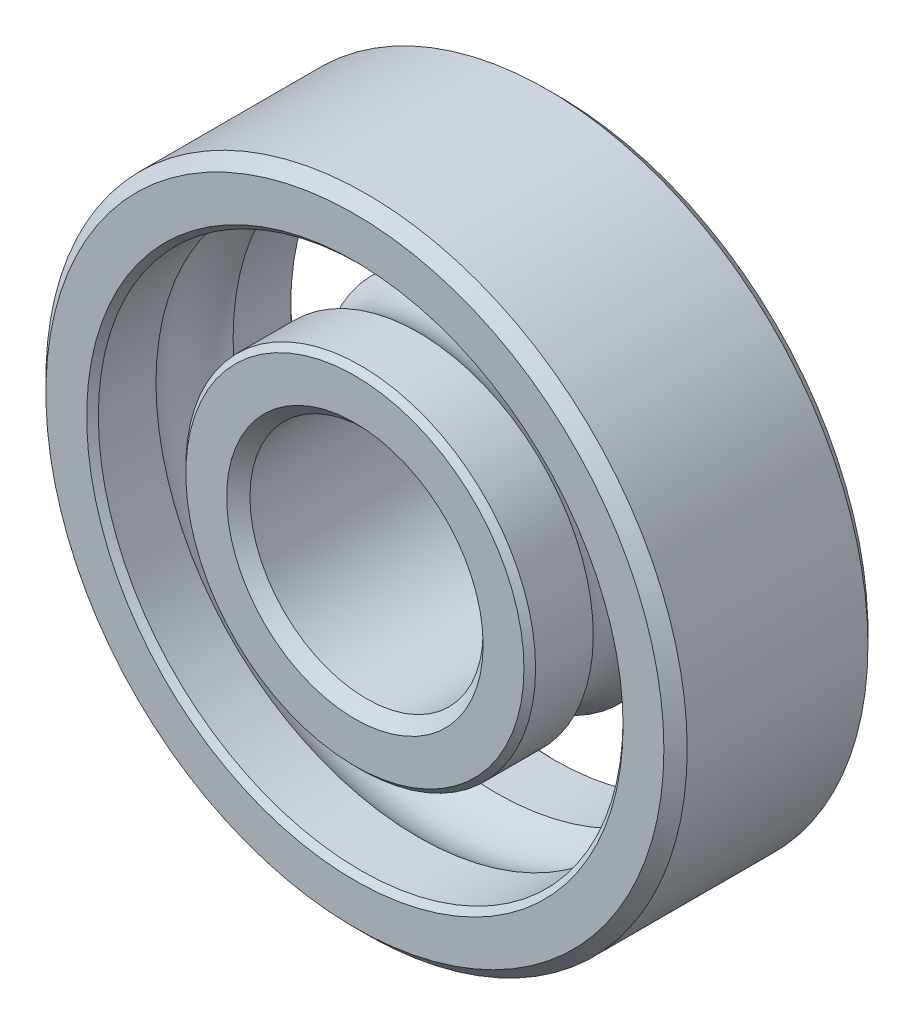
ISO-10303-21;
HEADER;
FILE_DESCRIPTION(('STEP AP214'),'2;1');
FILE_NAME('part.step','',(''),(''),'','','');
FILE_SCHEMA(('AUTOMOTIVE_DESIGN { 1 0 10303 214 1 1 1 1 }'));
ENDSEC;
DATA;
#1=APPLICATION_CONTEXT('core data for automotive mechanical design processes');
#2=APPLICATION_PROTOCOL_DEFINITION('international standard','automotive_design',2000,#1);
#3=PRODUCT_CONTEXT('',#1,'mechanical');
#4=PRODUCT('Part','Part','',(#3));
#5=PRODUCT_RELATED_PRODUCT_CATEGORY('part','',(#4));
#6=PRODUCT_DEFINITION_FORMATION('','',#4);
#7=PRODUCT_DEFINITION_CONTEXT('part definition',#1,'design');
#8=PRODUCT_DEFINITION('design','',#6,#7);
#9=PRODUCT_DEFINITION_SHAPE('','',#8);
#10=(LENGTH_UNIT() NAMED_UNIT(*) SI_UNIT(.MILLI.,.METRE.));
#11=(NAMED_UNIT(*) PLANE_ANGLE_UNIT() SI_UNIT($,.RADIAN.));
#12=(NAMED_UNIT(*) SI_UNIT($,.STERADIAN.) SOLID_ANGLE_UNIT());
#13=UNCERTAINTY_MEASURE_WITH_UNIT(LENGTH_MEASURE(1.E-05),#10,'distance_accuracy_value','');
#14=(GEOMETRIC_REPRESENTATION_CONTEXT(3) GLOBAL_UNCERTAINTY_ASSIGNED_CONTEXT((#13)) GLOBAL_UNIT_ASSIGNED_CONTEXT((#10,
#11,#12)) REPRESENTATION_CONTEXT('',''));
#15=CARTESIAN_POINT('',(0.,0.,0.));
#16=DIRECTION('',(0.,0.,1.));
#17=DIRECTION('',(1.,0.,0.));
#18=AXIS2_PLACEMENT_3D('',#15,#16,#17);
#19=CARTESIAN_POINT('',(0.,0.,0.));
#20=DIRECTION('',(0.,0.,1.));
#21=DIRECTION('',(1.,0.,0.));
#22=AXIS2_PLACEMENT_3D('',#19,#20,#21);
#23=CYLINDRICAL_SURFACE('',#22,9.);
#24=CARTESIAN_POINT('',(0.,0.,3.3));
#25=DIRECTION('',(0.,0.,1.));
#26=DIRECTION('',(1.,0.,0.));
#27=AXIS2_PLACEMENT_3D('',#24,#25,#26);
#28=CIRCLE('',#27,9.);
#29=CARTESIAN_POINT('',(9.,0.,3.3));
#30=VERTEX_POINT('',#29);
#31=EDGE_CURVE('E65',#30,#30,#28,.T.);
#32=ORIENTED_EDGE('',*,*,#31,.T.);
#33=EDGE_LOOP('',(#32));
#34=FACE_BOUND('',#33,.T.);
#35=CARTESIAN_POINT('',(0.,0.,1.32287565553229));
#36=DIRECTION('',(0.,0.,1.));
#37=DIRECTION('',(1.,0.,0.));
#38=AXIS2_PLACEMENT_3D('',#35,#36,#37);
#39=CIRCLE('',#38,9.);
#40=CARTESIAN_POINT('',(9.,0.,1.32287565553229));
#41=VERTEX_POINT('',#40);
#42=EDGE_CURVE('E71',#41,#41,#39,.T.);
#43=ORIENTED_EDGE('',*,*,#42,.F.);
#44=EDGE_LOOP('',(#43));
#45=FACE_BOUND('',#44,.T.);
#46=ADVANCED_FACE('F36',(#34,#45),#23,.F.);
#47=CARTESIAN_POINT('',(11.,0.,3.5));
#48=DIRECTION('',(0.,0.,1.));
#49=DIRECTION('',(1.,0.,0.));
#50=AXIS2_PLACEMENT_3D('',#47,#48,#49);
#51=PLANE('',#50);
#52=CARTESIAN_POINT('',(0.,0.,3.5));
#53=DIRECTION('',(0.,0.,1.));
#54=DIRECTION('',(1.,0.,0.));
#55=AXIS2_PLACEMENT_3D('',#52,#53,#54);
#56=CIRCLE('',#55,10.6);
#57=CARTESIAN_POINT('',(10.6,0.,3.5));
#58=VERTEX_POINT('',#57);
#59=EDGE_CURVE('E51',#58,#58,#56,.T.);
#60=ORIENTED_EDGE('',*,*,#59,.T.);
#61=EDGE_LOOP('',(#60));
#62=FACE_BOUND('',#61,.T.);
#63=CARTESIAN_POINT('',(0.,0.,3.5));
#64=DIRECTION('',(0.,0.,1.));
#65=DIRECTION('',(1.,0.,0.));
#66=AXIS2_PLACEMENT_3D('',#63,#64,#65);
#67=CIRCLE('',#66,9.2);
#68=CARTESIAN_POINT('',(9.2,0.,3.5));
#69=VERTEX_POINT('',#68);
#70=EDGE_CURVE('E62',#69,#69,#67,.F.);
#71=ORIENTED_EDGE('',*,*,#70,.T.);
#72=EDGE_LOOP('',(#71));
#73=FACE_BOUND('',#72,.T.);
#74=ADVANCED_FACE('F79',(#62,#73),#51,.T.);
#75=CARTESIAN_POINT('',(0.,0.,0.));
#76=DIRECTION('',(0.,0.,1.));
#77=DIRECTION('',(1.,0.,0.));
#78=AXIS2_PLACEMENT_3D('',#75,#76,#77);
#79=CYLINDRICAL_SURFACE('',#78,11.);
#80=CARTESIAN_POINT('',(0.,0.,3.09999999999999));
#81=DIRECTION('',(0.,0.,1.));
#82=DIRECTION('',(1.,0.,0.));
#83=AXIS2_PLACEMENT_3D('',#80,#81,#82);
#84=CIRCLE('',#83,11.);
#85=CARTESIAN_POINT('',(11.,0.,3.09999999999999));
#86=VERTEX_POINT('',#85);
#87=EDGE_CURVE('E43',#86,#86,#84,.F.);
#88=ORIENTED_EDGE('',*,*,#87,.T.);
#89=EDGE_LOOP('',(#88));
#90=FACE_BOUND('',#89,.T.);
#91=CARTESIAN_POINT('',(0.,0.,-3.1));
#92=DIRECTION('',(0.,0.,-1.));
#93=DIRECTION('',(-1.,0.,0.));
#94=AXIS2_PLACEMENT_3D('',#91,#92,#93);
#95=CIRCLE('',#94,11.);
#96=CARTESIAN_POINT('',(-11.,0.,-3.1));
#97=VERTEX_POINT('',#96);
#98=EDGE_CURVE('E47',#97,#97,#95,.F.);
#99=ORIENTED_EDGE('',*,*,#98,.T.);
#100=EDGE_LOOP('',(#99));
#101=FACE_BOUND('',#100,.T.);
#102=ADVANCED_FACE('F85',(#90,#101),#79,.T.);
#103=CARTESIAN_POINT('',(11.,0.,-3.5));
#104=DIRECTION('',(0.,0.,-1.));
#105=DIRECTION('',(-1.,0.,0.));
#106=AXIS2_PLACEMENT_3D('',#103,#104,#105);
#107=PLANE('',#106);
#108=CARTESIAN_POINT('',(0.,0.,-3.5));
#109=DIRECTION('',(0.,0.,-1.));
#110=DIRECTION('',(-1.,0.,0.));
#111=AXIS2_PLACEMENT_3D('',#108,#109,#110);
#112=CIRCLE('',#111,10.6);
#113=CARTESIAN_POINT('',(-10.6,0.,-3.5));
#114=VERTEX_POINT('',#113);
#115=EDGE_CURVE('E11',#114,#114,#112,.T.);
#116=ORIENTED_EDGE('',*,*,#115,.T.);
#117=EDGE_LOOP('',(#116));
#118=FACE_BOUND('',#117,.T.);
#119=CARTESIAN_POINT('',(0.,0.,-3.5));
#120=DIRECTION('',(0.,0.,-1.));
#121=DIRECTION('',(-1.,0.,0.));
#122=AXIS2_PLACEMENT_3D('',#119,#120,#121);
#123=CIRCLE('',#122,9.2);
#124=CARTESIAN_POINT('',(-9.2,0.,-3.5));
#125=VERTEX_POINT('',#124);
#126=EDGE_CURVE('E59',#125,#125,#123,.F.);
#127=ORIENTED_EDGE('',*,*,#126,.T.);
#128=EDGE_LOOP('',(#127));
#129=FACE_BOUND('',#128,.T.);
#130=ADVANCED_FACE('F116',(#118,#129),#107,.T.);
#131=CARTESIAN_POINT('',(0.,0.,0.));
#132=DIRECTION('',(0.,0.,1.));
#133=DIRECTION('',(1.,0.,0.));
#134=AXIS2_PLACEMENT_3D('',#131,#132,#133);
#135=CYLINDRICAL_SURFACE('',#134,9.);
#136=CARTESIAN_POINT('',(0.,0.,-3.3));
#137=DIRECTION('',(0.,0.,-1.));
#138=DIRECTION('',(-1.,0.,0.));
#139=AXIS2_PLACEMENT_3D('',#136,#137,#138);
#140=CIRCLE('',#139,9.);
#141=CARTESIAN_POINT('',(-9.,0.,-3.3));
#142=VERTEX_POINT('',#141);
#143=EDGE_CURVE('E56',#142,#142,#140,.T.);
#144=ORIENTED_EDGE('',*,*,#143,.T.);
#145=EDGE_LOOP('',(#144));
#146=FACE_BOUND('',#145,.T.);
#147=CARTESIAN_POINT('',(0.,0.,-1.32287565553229));
#148=DIRECTION('',(0.,0.,1.));
#149=DIRECTION('',(1.,0.,0.));
#150=AXIS2_PLACEMENT_3D('',#147,#148,#149);
#151=CIRCLE('',#150,9.);
#152=CARTESIAN_POINT('',(9.,0.,-1.32287565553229));
#153=VERTEX_POINT('',#152);
#154=EDGE_CURVE('E68',#153,#153,#151,.T.);
#155=ORIENTED_EDGE('',*,*,#154,.T.);
#156=EDGE_LOOP('',(#155));
#157=FACE_BOUND('',#156,.T.);
#158=ADVANCED_FACE('F120',(#146,#157),#135,.F.);
#159=CARTESIAN_POINT('',(0.,0.,0.));
#160=DIRECTION('',(0.,0.,1.));
#161=DIRECTION('',(1.,0.,0.));
#162=AXIS2_PLACEMENT_3D('',#159,#160,#161);
#163=TOROIDAL_SURFACE('',#162,7.5,2.);
#164=ORIENTED_EDGE('',*,*,#42,.T.);
#165=EDGE_LOOP('',(#164));
#166=FACE_BOUND('',#165,.T.);
#167=ORIENTED_EDGE('',*,*,#154,.F.);
#168=EDGE_LOOP('',(#167));
#169=FACE_BOUND('',#168,.T.);
#170=ADVANCED_FACE('F75',(#166,#169),#163,.F.);
#171=CARTESIAN_POINT('',(0.,0.,3.3));
#172=DIRECTION('',(0.,0.,1.));
#173=DIRECTION('',(1.,0.,0.));
#174=AXIS2_PLACEMENT_3D('',#171,#172,#173);
#175=CONICAL_SURFACE('',#174,9.,0.785398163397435);
#176=ORIENTED_EDGE('',*,*,#70,.F.);
#177=EDGE_LOOP('',(#176));
#178=FACE_BOUND('',#177,.T.);
#179=ORIENTED_EDGE('',*,*,#31,.F.);
#180=EDGE_LOOP('',(#179));
#181=FACE_BOUND('',#180,.T.);
#182=ADVANCED_FACE('F90',(#178,#181),#175,.F.);
#183=CARTESIAN_POINT('',(0.,0.,-3.5));
#184=DIRECTION('',(0.,0.,-1.));
#185=DIRECTION('',(-1.,0.,0.));
#186=AXIS2_PLACEMENT_3D('',#183,#184,#185);
#187=CONICAL_SURFACE('',#186,9.2,0.785398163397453);
#188=ORIENTED_EDGE('',*,*,#143,.F.);
#189=EDGE_LOOP('',(#188));
#190=FACE_BOUND('',#189,.T.);
#191=ORIENTED_EDGE('',*,*,#126,.F.);
#192=EDGE_LOOP('',(#191));
#193=FACE_BOUND('',#192,.T.);
#194=ADVANCED_FACE('F93',(#190,#193),#187,.F.);
#195=CARTESIAN_POINT('',(0.,0.,3.5));
#196=DIRECTION('',(0.,0.,-1.));
#197=DIRECTION('',(-1.,0.,0.));
#198=AXIS2_PLACEMENT_3D('',#195,#196,#197);
#199=CONICAL_SURFACE('',#198,10.6,0.785398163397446);
#200=ORIENTED_EDGE('',*,*,#87,.F.);
#201=EDGE_LOOP('',(#200));
#202=FACE_BOUND('',#201,.T.);
#203=ORIENTED_EDGE('',*,*,#59,.F.);
#204=EDGE_LOOP('',(#203));
#205=FACE_BOUND('',#204,.T.);
#206=ADVANCED_FACE('F96',(#202,#205),#199,.T.);
#207=CARTESIAN_POINT('',(0.,0.,-3.1));
#208=DIRECTION('',(0.,0.,1.));
#209=DIRECTION('',(1.,0.,0.));
#210=AXIS2_PLACEMENT_3D('',#207,#208,#209);
#211=CONICAL_SURFACE('',#210,11.,0.785398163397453);
#212=ORIENTED_EDGE('',*,*,#115,.F.);
#213=EDGE_LOOP('',(#212));
#214=FACE_BOUND('',#213,.T.);
#215=ORIENTED_EDGE('',*,*,#98,.F.);
#216=EDGE_LOOP('',(#215));
#217=FACE_BOUND('',#216,.T.);
#218=ADVANCED_FACE('F38',(#214,#217),#211,.T.);
#219=CLOSED_SHELL('',(#46,#74,#102,#130,#158,#170,#182,#194,#206,#218));
#220=MANIFOLD_SOLID_BREP('B2',#219);
#221=CARTESIAN_POINT('',(0.,0.,0.));
#222=DIRECTION('',(0.,0.,1.));
#223=DIRECTION('',(1.,0.,0.));
#224=AXIS2_PLACEMENT_3D('',#221,#222,#223);
#225=CYLINDRICAL_SURFACE('',#224,4.);
#226=CARTESIAN_POINT('',(0.,0.,-3.1));
#227=DIRECTION('',(0.,0.,-1.));
#228=DIRECTION('',(-1.,0.,0.));
#229=AXIS2_PLACEMENT_3D('',#226,#227,#228);
#230=CIRCLE('',#229,4.);
#231=CARTESIAN_POINT('',(-4.,0.,-3.1));
#232=VERTEX_POINT('',#231);
#233=EDGE_CURVE('E210',#232,#232,#230,.T.);
#234=ORIENTED_EDGE('',*,*,#233,.T.);
#235=EDGE_LOOP('',(#234));
#236=FACE_BOUND('',#235,.T.);
#237=CARTESIAN_POINT('',(0.,0.,3.1));
#238=DIRECTION('',(0.,0.,1.));
#239=DIRECTION('',(1.,0.,0.));
#240=AXIS2_PLACEMENT_3D('',#237,#238,#239);
#241=CIRCLE('',#240,4.);
#242=CARTESIAN_POINT('',(4.,0.,3.1));
#243=VERTEX_POINT('',#242);
#244=EDGE_CURVE('E213',#243,#243,#241,.T.);
#245=ORIENTED_EDGE('',*,*,#244,.T.);
#246=EDGE_LOOP('',(#245));
#247=FACE_BOUND('',#246,.T.);
#248=ADVANCED_FACE('F187',(#236,#247),#225,.F.);
#249=CARTESIAN_POINT('',(4.,0.,-3.5));
#250=DIRECTION('',(0.,0.,-1.));
#251=DIRECTION('',(-1.,0.,0.));
#252=AXIS2_PLACEMENT_3D('',#249,#250,#251);
#253=PLANE('',#252);
#254=CARTESIAN_POINT('',(0.,0.,-3.5));
#255=DIRECTION('',(0.,0.,-1.));
#256=DIRECTION('',(-1.,0.,0.));
#257=AXIS2_PLACEMENT_3D('',#254,#255,#256);
#258=CIRCLE('',#257,5.8);
#259=CARTESIAN_POINT('',(-5.8,0.,-3.5));
#260=VERTEX_POINT('',#259);
#261=EDGE_CURVE('E198',#260,#260,#258,.T.);
#262=ORIENTED_EDGE('',*,*,#261,.T.);
#263=EDGE_LOOP('',(#262));
#264=FACE_BOUND('',#263,.T.);
#265=CARTESIAN_POINT('',(0.,0.,-3.5));
#266=DIRECTION('',(0.,0.,-1.));
#267=DIRECTION('',(-1.,0.,0.));
#268=AXIS2_PLACEMENT_3D('',#265,#266,#267);
#269=CIRCLE('',#268,4.4);
#270=CARTESIAN_POINT('',(-4.4,0.,-3.5));
#271=VERTEX_POINT('',#270);
#272=EDGE_CURVE('E216',#271,#271,#269,.F.);
#273=ORIENTED_EDGE('',*,*,#272,.T.);
#274=EDGE_LOOP('',(#273));
#275=FACE_BOUND('',#274,.T.);
#276=ADVANCED_FACE('F239',(#264,#275),#253,.T.);
#277=CARTESIAN_POINT('',(0.,0.,0.));
#278=DIRECTION('',(0.,0.,1.));
#279=DIRECTION('',(1.,0.,0.));
#280=AXIS2_PLACEMENT_3D('',#277,#278,#279);
#281=CYLINDRICAL_SURFACE('',#280,6.);
#282=CARTESIAN_POINT('',(0.,0.,-3.3));
#283=DIRECTION('',(0.,0.,-1.));
#284=DIRECTION('',(-1.,0.,0.));
#285=AXIS2_PLACEMENT_3D('',#282,#283,#284);
#286=CIRCLE('',#285,6.);
#287=CARTESIAN_POINT('',(-6.,0.,-3.3));
#288=VERTEX_POINT('',#287);
#289=EDGE_CURVE('E202',#288,#288,#286,.F.);
#290=ORIENTED_EDGE('',*,*,#289,.T.);
#291=EDGE_LOOP('',(#290));
#292=FACE_BOUND('',#291,.T.);
#293=CARTESIAN_POINT('',(0.,0.,-1.32287565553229));
#294=DIRECTION('',(0.,0.,1.));
#295=DIRECTION('',(1.,0.,0.));
#296=AXIS2_PLACEMENT_3D('',#293,#294,#295);
#297=CIRCLE('',#296,6.);
#298=CARTESIAN_POINT('',(6.,0.,-1.32287565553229));
#299=VERTEX_POINT('',#298);
#300=EDGE_CURVE('E219',#299,#299,#297,.T.);
#301=ORIENTED_EDGE('',*,*,#300,.F.);
#302=EDGE_LOOP('',(#301));
#303=FACE_BOUND('',#302,.T.);
#304=ADVANCED_FACE('F230',(#292,#303),#281,.T.);
#305=CARTESIAN_POINT('',(0.,0.,0.));
#306=DIRECTION('',(0.,0.,1.));
#307=DIRECTION('',(1.,0.,0.));
#308=AXIS2_PLACEMENT_3D('',#305,#306,#307);
#309=TOROIDAL_SURFACE('',#308,7.5,2.);
#310=ORIENTED_EDGE('',*,*,#300,.T.);
#311=EDGE_LOOP('',(#310));
#312=FACE_BOUND('',#311,.T.);
#313=CARTESIAN_POINT('',(0.,0.,1.3228756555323));
#314=DIRECTION('',(0.,0.,1.));
#315=DIRECTION('',(1.,0.,0.));
#316=AXIS2_PLACEMENT_3D('',#313,#314,#315);
#317=CIRCLE('',#316,6.);
#318=CARTESIAN_POINT('',(6.,0.,1.3228756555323));
#319=VERTEX_POINT('',#318);
#320=EDGE_CURVE('E222',#319,#319,#317,.T.);
#321=ORIENTED_EDGE('',*,*,#320,.F.);
#322=EDGE_LOOP('',(#321));
#323=FACE_BOUND('',#322,.T.);
#324=ADVANCED_FACE('F228',(#312,#323),#309,.F.);
#325=CARTESIAN_POINT('',(0.,0.,0.));
#326=DIRECTION('',(0.,0.,1.));
#327=DIRECTION('',(1.,0.,0.));
#328=AXIS2_PLACEMENT_3D('',#325,#326,#327);
#329=CYLINDRICAL_SURFACE('',#328,6.);
#330=CARTESIAN_POINT('',(0.,0.,3.3));
#331=DIRECTION('',(0.,0.,1.));
#332=DIRECTION('',(1.,0.,0.));
#333=AXIS2_PLACEMENT_3D('',#330,#331,#332);
#334=CIRCLE('',#333,6.);
#335=CARTESIAN_POINT('',(6.,0.,3.3));
#336=VERTEX_POINT('',#335);
#337=EDGE_CURVE('E35',#336,#336,#334,.F.);
#338=ORIENTED_EDGE('',*,*,#337,.T.);
#339=EDGE_LOOP('',(#338));
#340=FACE_BOUND('',#339,.T.);
#341=ORIENTED_EDGE('',*,*,#320,.T.);
#342=EDGE_LOOP('',(#341));
#343=FACE_BOUND('',#342,.T.);
#344=ADVANCED_FACE('F226',(#340,#343),#329,.T.);
#345=CARTESIAN_POINT('',(4.,0.,3.5));
#346=DIRECTION('',(0.,0.,1.));
#347=DIRECTION('',(1.,0.,0.));
#348=AXIS2_PLACEMENT_3D('',#345,#346,#347);
#349=PLANE('',#348);
#350=CARTESIAN_POINT('',(0.,0.,3.5));
#351=DIRECTION('',(0.,0.,1.));
#352=DIRECTION('',(1.,0.,0.));
#353=AXIS2_PLACEMENT_3D('',#350,#351,#352);
#354=CIRCLE('',#353,5.79999999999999);
#355=CARTESIAN_POINT('',(5.79999999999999,0.,3.5));
#356=VERTEX_POINT('',#355);
#357=EDGE_CURVE('E194',#356,#356,#354,.T.);
#358=ORIENTED_EDGE('',*,*,#357,.T.);
#359=EDGE_LOOP('',(#358));
#360=FACE_BOUND('',#359,.T.);
#361=CARTESIAN_POINT('',(0.,0.,3.5));
#362=DIRECTION('',(0.,0.,1.));
#363=DIRECTION('',(1.,0.,0.));
#364=AXIS2_PLACEMENT_3D('',#361,#362,#363);
#365=CIRCLE('',#364,4.4);
#366=CARTESIAN_POINT('',(4.4,0.,3.5));
#367=VERTEX_POINT('',#366);
#368=EDGE_CURVE('E207',#367,#367,#365,.F.);
#369=ORIENTED_EDGE('',*,*,#368,.T.);
#370=EDGE_LOOP('',(#369));
#371=FACE_BOUND('',#370,.T.);
#372=ADVANCED_FACE('F237',(#360,#371),#349,.T.);
#373=CARTESIAN_POINT('',(0.,0.,-3.5));
#374=DIRECTION('',(0.,0.,-1.));
#375=DIRECTION('',(-1.,0.,0.));
#376=AXIS2_PLACEMENT_3D('',#373,#374,#375);
#377=CONICAL_SURFACE('',#376,4.4,0.785398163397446);
#378=CARTESIAN_POINT('',(-4.,0.,-3.1));
#379=CARTESIAN_POINT('',(-4.00416666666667,0.,-3.10416666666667));
#380=CARTESIAN_POINT('',(-4.00833333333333,0.,-3.10833333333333));
#381=CARTESIAN_POINT('',(-4.01666666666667,0.,-3.11666666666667));
#382=CARTESIAN_POINT('',(-4.02083333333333,0.,-3.12083333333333));
#383=CARTESIAN_POINT('',(-4.02916666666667,0.,-3.12916666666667));
#384=CARTESIAN_POINT('',(-4.03333333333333,0.,-3.13333333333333));
#385=CARTESIAN_POINT('',(-4.04166666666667,0.,-3.14166666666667));
#386=CARTESIAN_POINT('',(-4.04583333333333,0.,-3.14583333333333));
#387=CARTESIAN_POINT('',(-4.05416666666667,0.,-3.15416666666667));
#388=CARTESIAN_POINT('',(-4.05833333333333,0.,-3.15833333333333));
#389=CARTESIAN_POINT('',(-4.06666666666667,0.,-3.16666666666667));
#390=CARTESIAN_POINT('',(-4.07083333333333,0.,-3.17083333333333));
#391=CARTESIAN_POINT('',(-4.07916666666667,0.,-3.17916666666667));
#392=CARTESIAN_POINT('',(-4.08333333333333,0.,-3.18333333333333));
#393=CARTESIAN_POINT('',(-4.09166666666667,0.,-3.19166666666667));
#394=CARTESIAN_POINT('',(-4.09583333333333,0.,-3.19583333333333));
#395=CARTESIAN_POINT('',(-4.10416666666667,0.,-3.20416666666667));
#396=CARTESIAN_POINT('',(-4.10833333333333,0.,-3.20833333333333));
#397=CARTESIAN_POINT('',(-4.11666666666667,0.,-3.21666666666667));
#398=CARTESIAN_POINT('',(-4.12083333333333,0.,-3.22083333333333));
#399=CARTESIAN_POINT('',(-4.12916666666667,0.,-3.22916666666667));
#400=CARTESIAN_POINT('',(-4.13333333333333,0.,-3.23333333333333));
#401=CARTESIAN_POINT('',(-4.14166666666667,0.,-3.24166666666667));
#402=CARTESIAN_POINT('',(-4.14583333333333,0.,-3.24583333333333));
#403=CARTESIAN_POINT('',(-4.15416666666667,0.,-3.25416666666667));
#404=CARTESIAN_POINT('',(-4.15833333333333,0.,-3.25833333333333));
#405=CARTESIAN_POINT('',(-4.16666666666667,0.,-3.26666666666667));
#406=CARTESIAN_POINT('',(-4.17083333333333,0.,-3.27083333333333));
#407=CARTESIAN_POINT('',(-4.17916666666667,0.,-3.27916666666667));
#408=CARTESIAN_POINT('',(-4.18333333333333,0.,-3.28333333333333));
#409=CARTESIAN_POINT('',(-4.19166666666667,0.,-3.29166666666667));
#410=CARTESIAN_POINT('',(-4.19583333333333,0.,-3.29583333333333));
#411=CARTESIAN_POINT('',(-4.20416666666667,0.,-3.30416666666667));
#412=CARTESIAN_POINT('',(-4.20833333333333,0.,-3.30833333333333));
#413=CARTESIAN_POINT('',(-4.21666666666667,0.,-3.31666666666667));
#414=CARTESIAN_POINT('',(-4.22083333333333,0.,-3.32083333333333));
#415=CARTESIAN_POINT('',(-4.22916666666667,0.,-3.32916666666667));
#416=CARTESIAN_POINT('',(-4.23333333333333,0.,-3.33333333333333));
#417=CARTESIAN_POINT('',(-4.24166666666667,0.,-3.34166666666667));
#418=CARTESIAN_POINT('',(-4.24583333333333,0.,-3.34583333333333));
#419=CARTESIAN_POINT('',(-4.25416666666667,0.,-3.35416666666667));
#420=CARTESIAN_POINT('',(-4.25833333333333,0.,-3.35833333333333));
#421=CARTESIAN_POINT('',(-4.26666666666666,0.,-3.36666666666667));
#422=CARTESIAN_POINT('',(-4.27083333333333,0.,-3.37083333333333));
#423=CARTESIAN_POINT('',(-4.27916666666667,0.,-3.37916666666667));
#424=CARTESIAN_POINT('',(-4.28333333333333,0.,-3.38333333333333));
#425=CARTESIAN_POINT('',(-4.29166666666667,0.,-3.39166666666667));
#426=CARTESIAN_POINT('',(-4.29583333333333,0.,-3.39583333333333));
#427=CARTESIAN_POINT('',(-4.30416666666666,0.,-3.40416666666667));
#428=CARTESIAN_POINT('',(-4.30833333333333,0.,-3.40833333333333));
#429=CARTESIAN_POINT('',(-4.31666666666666,0.,-3.41666666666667));
#430=CARTESIAN_POINT('',(-4.32083333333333,0.,-3.42083333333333));
#431=CARTESIAN_POINT('',(-4.32916666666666,0.,-3.42916666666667));
#432=CARTESIAN_POINT('',(-4.33333333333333,0.,-3.43333333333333));
#433=CARTESIAN_POINT('',(-4.34166666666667,0.,-3.44166666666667));
#434=CARTESIAN_POINT('',(-4.34583333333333,0.,-3.44583333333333));
#435=CARTESIAN_POINT('',(-4.35416666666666,0.,-3.45416666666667));
#436=CARTESIAN_POINT('',(-4.35833333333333,0.,-3.45833333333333));
#437=CARTESIAN_POINT('',(-4.36666666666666,0.,-3.46666666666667));
#438=CARTESIAN_POINT('',(-4.37083333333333,0.,-3.47083333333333));
#439=CARTESIAN_POINT('',(-4.37916666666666,0.,-3.47916666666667));
#440=CARTESIAN_POINT('',(-4.38333333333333,0.,-3.48333333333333));
#441=CARTESIAN_POINT('',(-4.39166666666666,0.,-3.49166666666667));
#442=CARTESIAN_POINT('',(-4.39583333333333,0.,-3.49583333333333));
#443=CARTESIAN_POINT('',(-4.4,0.,-3.5));
#444=B_SPLINE_CURVE_WITH_KNOTS('',3,(#378,#379,#380,#381,#382,#383,#384,#385,#386,#387,#388,
#389,#390,#391,#392,#393,#394,#395,#396,#397,#398,#399,#400,#401,#402,#403,#404,#405,#406,#407,
#408,#409,#410,#411,#412,#413,#414,#415,#416,#417,#418,#419,#420,#421,#422,#423,#424,#425,#426,
#427,#428,#429,#430,#431,#432,#433,#434,#435,#436,#437,#438,#439,#440,#441,#442,#443),
.UNSPECIFIED.,.F.,.F.,(4,2,2,2,2,2,2,2,2,2,2,2,2,2,2,2,2,2,2,2,2,2,2,2,2,2,2,2,2,2,2,2,4),(0.,
0.0176776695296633,0.0353553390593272,0.0530330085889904,0.0707106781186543,0.0883883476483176,
0.106066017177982,0.123743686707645,0.141421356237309,0.159099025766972,0.176776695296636,
0.194454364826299,0.212132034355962,0.229809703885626,0.24748737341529,0.265165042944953,
0.282842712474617,0.300520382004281,0.318198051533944,0.335875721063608,0.353553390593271,
0.371231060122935,0.388908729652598,0.406586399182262,0.424264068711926,0.441941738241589,
0.459619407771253,0.477297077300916,0.49497474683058,0.512652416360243,0.530330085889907,
0.548007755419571,0.565685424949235),.UNSPECIFIED.);
#445=EDGE_CURVE('BSEAM252',#232,#271,#444,.T.);
#446=ORIENTED_EDGE('',*,*,#233,.F.);
#447=ORIENTED_EDGE('',*,*,#272,.F.);
#448=ORIENTED_EDGE('',*,*,#445,.T.);
#449=ORIENTED_EDGE('',*,*,#445,.F.);
#450=EDGE_LOOP('',(#446,#448,#447,#449));
#451=FACE_BOUND('',#450,.T.);
#452=ADVANCED_FACE('F252',(#451),#377,.F.);
#453=CARTESIAN_POINT('',(0.,0.,3.1));
#454=DIRECTION('',(0.,0.,1.));
#455=DIRECTION('',(1.,0.,0.));
#456=AXIS2_PLACEMENT_3D('',#453,#454,#455);
#457=CONICAL_SURFACE('',#456,4.,0.785398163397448);
#458=ORIENTED_EDGE('',*,*,#368,.F.);
#459=EDGE_LOOP('',(#458));
#460=FACE_BOUND('',#459,.T.);
#461=ORIENTED_EDGE('',*,*,#244,.F.);
#462=EDGE_LOOP('',(#461));
#463=FACE_BOUND('',#462,.T.);
#464=ADVANCED_FACE('F255',(#460,#463),#457,.F.);
#465=CARTESIAN_POINT('',(0.,0.,-3.3));
#466=DIRECTION('',(0.,0.,1.));
#467=DIRECTION('',(1.,0.,0.));
#468=AXIS2_PLACEMENT_3D('',#465,#466,#467);
#469=CONICAL_SURFACE('',#468,6.,0.785398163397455);
#470=ORIENTED_EDGE('',*,*,#261,.F.);
#471=EDGE_LOOP('',(#470));
#472=FACE_BOUND('',#471,.T.);
#473=ORIENTED_EDGE('',*,*,#289,.F.);
#474=EDGE_LOOP('',(#473));
#475=FACE_BOUND('',#474,.T.);
#476=ADVANCED_FACE('F258',(#472,#475),#469,.T.);
#477=CARTESIAN_POINT('',(0.,0.,3.5));
#478=DIRECTION('',(0.,0.,-1.));
#479=DIRECTION('',(-1.,0.,0.));
#480=AXIS2_PLACEMENT_3D('',#477,#478,#479);
#481=CONICAL_SURFACE('',#480,5.79999999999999,0.785398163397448);
#482=ORIENTED_EDGE('',*,*,#337,.F.);
#483=EDGE_LOOP('',(#482));
#484=FACE_BOUND('',#483,.T.);
#485=ORIENTED_EDGE('',*,*,#357,.F.);
#486=EDGE_LOOP('',(#485));
#487=FACE_BOUND('',#486,.T.);
#488=ADVANCED_FACE('F189',(#484,#487),#481,.T.);
#489=CLOSED_SHELL('',(#248,#276,#304,#324,#344,#372,#452,#464,#476,#488));
#490=MANIFOLD_SOLID_BREP('B6',#489);
#491=ADVANCED_BREP_SHAPE_REPRESENTATION('',(#18,#220,#490),#14);
#492=SHAPE_DEFINITION_REPRESENTATION(#9,#491);
ENDSEC;
END-ISO-10303-21;
